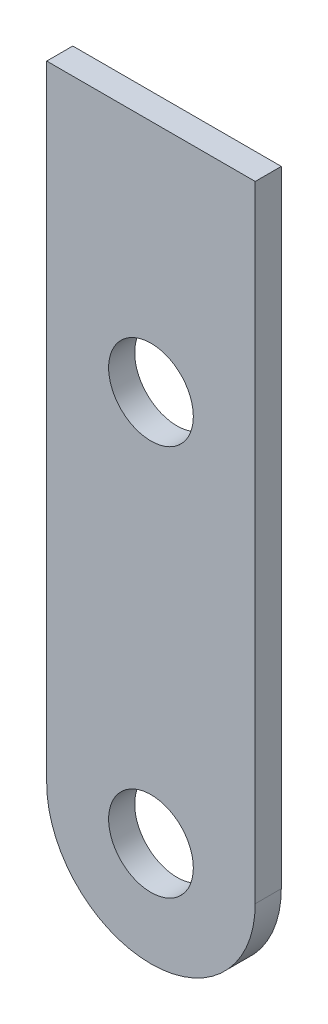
ISO-10303-21;
HEADER;
FILE_DESCRIPTION(('STEP AP214'),'2;1');
FILE_NAME('part.step','',(''),(''),'','','');
FILE_SCHEMA(('AUTOMOTIVE_DESIGN { 1 0 10303 214 1 1 1 1 }'));
ENDSEC;
DATA;
#1=APPLICATION_CONTEXT('core data for automotive mechanical design processes');
#2=APPLICATION_PROTOCOL_DEFINITION('international standard','automotive_design',2000,#1);
#3=PRODUCT_CONTEXT('',#1,'mechanical');
#4=PRODUCT('Part','Part','',(#3));
#5=PRODUCT_RELATED_PRODUCT_CATEGORY('part','',(#4));
#6=PRODUCT_DEFINITION_FORMATION('','',#4);
#7=PRODUCT_DEFINITION_CONTEXT('part definition',#1,'design');
#8=PRODUCT_DEFINITION('design','',#6,#7);
#9=PRODUCT_DEFINITION_SHAPE('','',#8);
#10=(LENGTH_UNIT() NAMED_UNIT(*) SI_UNIT(.MILLI.,.METRE.));
#11=(NAMED_UNIT(*) PLANE_ANGLE_UNIT() SI_UNIT($,.RADIAN.));
#12=(NAMED_UNIT(*) SI_UNIT($,.STERADIAN.) SOLID_ANGLE_UNIT());
#13=UNCERTAINTY_MEASURE_WITH_UNIT(LENGTH_MEASURE(1.E-05),#10,'distance_accuracy_value','');
#14=(GEOMETRIC_REPRESENTATION_CONTEXT(3) GLOBAL_UNCERTAINTY_ASSIGNED_CONTEXT((#13)) GLOBAL_UNIT_ASSIGNED_CONTEXT((#10,
#11,#12)) REPRESENTATION_CONTEXT('',''));
#15=CARTESIAN_POINT('',(0.,0.,0.));
#16=DIRECTION('',(0.,0.,1.));
#17=DIRECTION('',(1.,0.,0.));
#18=AXIS2_PLACEMENT_3D('',#15,#16,#17);
#19=CARTESIAN_POINT('',(25.4,-152.4,6.35));
#20=DIRECTION('',(0.,0.,1.));
#21=DIRECTION('',(1.,0.,0.));
#22=AXIS2_PLACEMENT_3D('',#19,#20,#21);
#23=PLANE('',#22);
#24=CARTESIAN_POINT('',(25.4,-152.4,6.35));
#25=DIRECTION('',(0.,0.,1.));
#26=DIRECTION('',(1.,0.,0.));
#27=AXIS2_PLACEMENT_3D('',#24,#25,#26);
#28=CIRCLE('',#27,10.31875);
#29=CARTESIAN_POINT('',(35.71875,-152.4,6.35));
#30=VERTEX_POINT('',#29);
#31=EDGE_CURVE('E99',#30,#30,#28,.T.);
#32=ORIENTED_EDGE('',*,*,#31,.F.);
#33=EDGE_LOOP('',(#32));
#34=FACE_BOUND('',#33,.T.);
#35=DIRECTION('',(-1.,0.,0.));
#36=VECTOR('',#35,1.);
#37=CARTESIAN_POINT('',(50.8,0.,6.35));
#38=LINE('',#37,#36);
#39=CARTESIAN_POINT('',(50.8,0.,6.35));
#40=VERTEX_POINT('',#39);
#41=CARTESIAN_POINT('',(0.,0.,6.35));
#42=VERTEX_POINT('',#41);
#43=EDGE_CURVE('E84',#40,#42,#38,.T.);
#44=ORIENTED_EDGE('',*,*,#43,.T.);
#45=DIRECTION('',(0.,-1.,0.));
#46=VECTOR('',#45,1.);
#47=CARTESIAN_POINT('',(0.,0.,6.35));
#48=LINE('',#47,#46);
#49=CARTESIAN_POINT('',(0.,-152.4,6.35));
#50=VERTEX_POINT('',#49);
#51=EDGE_CURVE('E79',#42,#50,#48,.T.);
#52=ORIENTED_EDGE('',*,*,#51,.T.);
#53=CARTESIAN_POINT('',(25.4,-152.4,6.35));
#54=DIRECTION('',(0.,0.,1.));
#55=DIRECTION('',(1.,0.,0.));
#56=AXIS2_PLACEMENT_3D('',#53,#54,#55);
#57=CIRCLE('',#56,25.4);
#58=CARTESIAN_POINT('',(50.8,-152.4,6.35));
#59=VERTEX_POINT('',#58);
#60=EDGE_CURVE('E82',#50,#59,#57,.T.);
#61=ORIENTED_EDGE('',*,*,#60,.T.);
#62=DIRECTION('',(0.,1.,0.));
#63=VECTOR('',#62,1.);
#64=CARTESIAN_POINT('',(50.8,-152.4,6.35));
#65=LINE('',#64,#63);
#66=EDGE_CURVE('E49',#59,#40,#65,.T.);
#67=ORIENTED_EDGE('',*,*,#66,.T.);
#68=EDGE_LOOP('',(#44,#52,#61,#67));
#69=FACE_BOUND('',#68,.T.);
#70=CARTESIAN_POINT('',(25.4,-57.15,6.35));
#71=DIRECTION('',(0.,0.,1.));
#72=DIRECTION('',(1.,0.,0.));
#73=AXIS2_PLACEMENT_3D('',#70,#71,#72);
#74=CIRCLE('',#73,10.31875);
#75=CARTESIAN_POINT('',(35.71875,-57.15,6.35));
#76=VERTEX_POINT('',#75);
#77=EDGE_CURVE('E114',#76,#76,#74,.T.);
#78=ORIENTED_EDGE('',*,*,#77,.F.);
#79=EDGE_LOOP('',(#78));
#80=FACE_BOUND('',#79,.T.);
#81=ADVANCED_FACE('F32',(#34,#69,#80),#23,.T.);
#82=CARTESIAN_POINT('',(25.4,-152.4,0.));
#83=DIRECTION('',(0.,0.,1.));
#84=DIRECTION('',(1.,0.,0.));
#85=AXIS2_PLACEMENT_3D('',#82,#83,#84);
#86=PLANE('',#85);
#87=DIRECTION('',(-1.,0.,0.));
#88=VECTOR('',#87,1.);
#89=CARTESIAN_POINT('',(50.8,0.,0.));
#90=LINE('',#89,#88);
#91=CARTESIAN_POINT('',(50.8,0.,0.));
#92=VERTEX_POINT('',#91);
#93=CARTESIAN_POINT('',(0.,0.,0.));
#94=VERTEX_POINT('',#93);
#95=EDGE_CURVE('E96',#92,#94,#90,.T.);
#96=ORIENTED_EDGE('',*,*,#95,.F.);
#97=DIRECTION('',(0.,1.,0.));
#98=VECTOR('',#97,1.);
#99=CARTESIAN_POINT('',(50.8,-152.4,0.));
#100=LINE('',#99,#98);
#101=CARTESIAN_POINT('',(50.8,-152.4,0.));
#102=VERTEX_POINT('',#101);
#103=EDGE_CURVE('E72',#102,#92,#100,.T.);
#104=ORIENTED_EDGE('',*,*,#103,.F.);
#105=CARTESIAN_POINT('',(25.4,-152.4,0.));
#106=DIRECTION('',(0.,0.,1.));
#107=DIRECTION('',(1.,0.,0.));
#108=AXIS2_PLACEMENT_3D('',#105,#106,#107);
#109=CIRCLE('',#108,25.4);
#110=CARTESIAN_POINT('',(0.,-152.4,0.));
#111=VERTEX_POINT('',#110);
#112=EDGE_CURVE('E66',#111,#102,#109,.T.);
#113=ORIENTED_EDGE('',*,*,#112,.F.);
#114=DIRECTION('',(0.,-1.,0.));
#115=VECTOR('',#114,1.);
#116=CARTESIAN_POINT('',(0.,0.,0.));
#117=LINE('',#116,#115);
#118=EDGE_CURVE('E88',#94,#111,#117,.T.);
#119=ORIENTED_EDGE('',*,*,#118,.F.);
#120=EDGE_LOOP('',(#96,#104,#113,#119));
#121=FACE_BOUND('',#120,.T.);
#122=CARTESIAN_POINT('',(25.4,-152.4,0.));
#123=DIRECTION('',(0.,0.,1.));
#124=DIRECTION('',(1.,0.,0.));
#125=AXIS2_PLACEMENT_3D('',#122,#123,#124);
#126=CIRCLE('',#125,10.31875);
#127=CARTESIAN_POINT('',(35.71875,-152.4,0.));
#128=VERTEX_POINT('',#127);
#129=EDGE_CURVE('E111',#128,#128,#126,.T.);
#130=ORIENTED_EDGE('',*,*,#129,.T.);
#131=EDGE_LOOP('',(#130));
#132=FACE_BOUND('',#131,.T.);
#133=CARTESIAN_POINT('',(25.4,-57.15,0.));
#134=DIRECTION('',(0.,0.,1.));
#135=DIRECTION('',(1.,0.,0.));
#136=AXIS2_PLACEMENT_3D('',#133,#134,#135);
#137=CIRCLE('',#136,10.31875);
#138=CARTESIAN_POINT('',(35.71875,-57.15,0.));
#139=VERTEX_POINT('',#138);
#140=EDGE_CURVE('E117',#139,#139,#137,.T.);
#141=ORIENTED_EDGE('',*,*,#140,.T.);
#142=EDGE_LOOP('',(#141));
#143=FACE_BOUND('',#142,.T.);
#144=ADVANCED_FACE('F107',(#121,#132,#143),#86,.F.);
#145=CARTESIAN_POINT('',(50.8,0.,6.35));
#146=DIRECTION('',(0.,-1.,0.));
#147=DIRECTION('',(1.,0.,0.));
#148=AXIS2_PLACEMENT_3D('',#145,#146,#147);
#149=PLANE('',#148);
#150=ORIENTED_EDGE('',*,*,#95,.T.);
#151=DIRECTION('',(0.,0.,-1.));
#152=VECTOR('',#151,1.);
#153=CARTESIAN_POINT('',(0.,0.,6.35));
#154=LINE('',#153,#152);
#155=EDGE_CURVE('E11',#42,#94,#154,.T.);
#156=ORIENTED_EDGE('',*,*,#155,.F.);
#157=ORIENTED_EDGE('',*,*,#43,.F.);
#158=DIRECTION('',(0.,0.,-1.));
#159=VECTOR('',#158,1.);
#160=CARTESIAN_POINT('',(50.8,0.,6.35));
#161=LINE('',#160,#159);
#162=EDGE_CURVE('E92',#40,#92,#161,.T.);
#163=ORIENTED_EDGE('',*,*,#162,.T.);
#164=EDGE_LOOP('',(#150,#156,#157,#163));
#165=FACE_BOUND('',#164,.T.);
#166=ADVANCED_FACE('F34',(#165),#149,.F.);
#167=CARTESIAN_POINT('',(0.,0.,6.35));
#168=DIRECTION('',(1.,0.,0.));
#169=DIRECTION('',(0.,1.,0.));
#170=AXIS2_PLACEMENT_3D('',#167,#168,#169);
#171=PLANE('',#170);
#172=ORIENTED_EDGE('',*,*,#118,.T.);
#173=DIRECTION('',(0.,0.,-1.));
#174=VECTOR('',#173,1.);
#175=CARTESIAN_POINT('',(0.,-152.4,6.35));
#176=LINE('',#175,#174);
#177=EDGE_CURVE('E41',#50,#111,#176,.T.);
#178=ORIENTED_EDGE('',*,*,#177,.F.);
#179=ORIENTED_EDGE('',*,*,#51,.F.);
#180=ORIENTED_EDGE('',*,*,#155,.T.);
#181=EDGE_LOOP('',(#172,#178,#179,#180));
#182=FACE_BOUND('',#181,.T.);
#183=ADVANCED_FACE('F87',(#182),#171,.F.);
#184=CARTESIAN_POINT('',(25.4,-152.4,6.35));
#185=DIRECTION('',(0.,0.,-1.));
#186=DIRECTION('',(-1.,0.,0.));
#187=AXIS2_PLACEMENT_3D('',#184,#185,#186);
#188=CYLINDRICAL_SURFACE('',#187,25.4);
#189=ORIENTED_EDGE('',*,*,#112,.T.);
#190=DIRECTION('',(0.,0.,-1.));
#191=VECTOR('',#190,1.);
#192=CARTESIAN_POINT('',(50.8,-152.4,6.35));
#193=LINE('',#192,#191);
#194=EDGE_CURVE('E89',#59,#102,#193,.T.);
#195=ORIENTED_EDGE('',*,*,#194,.F.);
#196=ORIENTED_EDGE('',*,*,#60,.F.);
#197=ORIENTED_EDGE('',*,*,#177,.T.);
#198=EDGE_LOOP('',(#189,#195,#196,#197));
#199=FACE_BOUND('',#198,.T.);
#200=ADVANCED_FACE('F90',(#199),#188,.T.);
#201=CARTESIAN_POINT('',(50.8,-152.4,6.35));
#202=DIRECTION('',(-1.,0.,0.));
#203=DIRECTION('',(0.,-1.,0.));
#204=AXIS2_PLACEMENT_3D('',#201,#202,#203);
#205=PLANE('',#204);
#206=ORIENTED_EDGE('',*,*,#103,.T.);
#207=ORIENTED_EDGE('',*,*,#162,.F.);
#208=ORIENTED_EDGE('',*,*,#66,.F.);
#209=ORIENTED_EDGE('',*,*,#194,.T.);
#210=EDGE_LOOP('',(#206,#207,#208,#209));
#211=FACE_BOUND('',#210,.T.);
#212=ADVANCED_FACE('F104',(#211),#205,.F.);
#213=CARTESIAN_POINT('',(25.4,-152.4,6.35));
#214=DIRECTION('',(0.,0.,-1.));
#215=DIRECTION('',(-1.,0.,0.));
#216=AXIS2_PLACEMENT_3D('',#213,#214,#215);
#217=CYLINDRICAL_SURFACE('',#216,10.31875);
#218=ORIENTED_EDGE('',*,*,#31,.T.);
#219=EDGE_LOOP('',(#218));
#220=FACE_BOUND('',#219,.T.);
#221=ORIENTED_EDGE('',*,*,#129,.F.);
#222=EDGE_LOOP('',(#221));
#223=FACE_BOUND('',#222,.T.);
#224=ADVANCED_FACE('F134',(#220,#223),#217,.F.);
#225=CARTESIAN_POINT('',(25.4,-57.15,6.35));
#226=DIRECTION('',(0.,0.,-1.));
#227=DIRECTION('',(-1.,0.,0.));
#228=AXIS2_PLACEMENT_3D('',#225,#226,#227);
#229=CYLINDRICAL_SURFACE('',#228,10.31875);
#230=ORIENTED_EDGE('',*,*,#77,.T.);
#231=EDGE_LOOP('',(#230));
#232=FACE_BOUND('',#231,.T.);
#233=ORIENTED_EDGE('',*,*,#140,.F.);
#234=EDGE_LOOP('',(#233));
#235=FACE_BOUND('',#234,.T.);
#236=ADVANCED_FACE('F123',(#232,#235),#229,.F.);
#237=CLOSED_SHELL('',(#81,#144,#166,#183,#200,#212,#224,#236));
#238=MANIFOLD_SOLID_BREP('B2',#237);
#239=ADVANCED_BREP_SHAPE_REPRESENTATION('',(#18,#238),#14);
#240=SHAPE_DEFINITION_REPRESENTATION(#9,#239);
ENDSEC;
END-ISO-10303-21;
